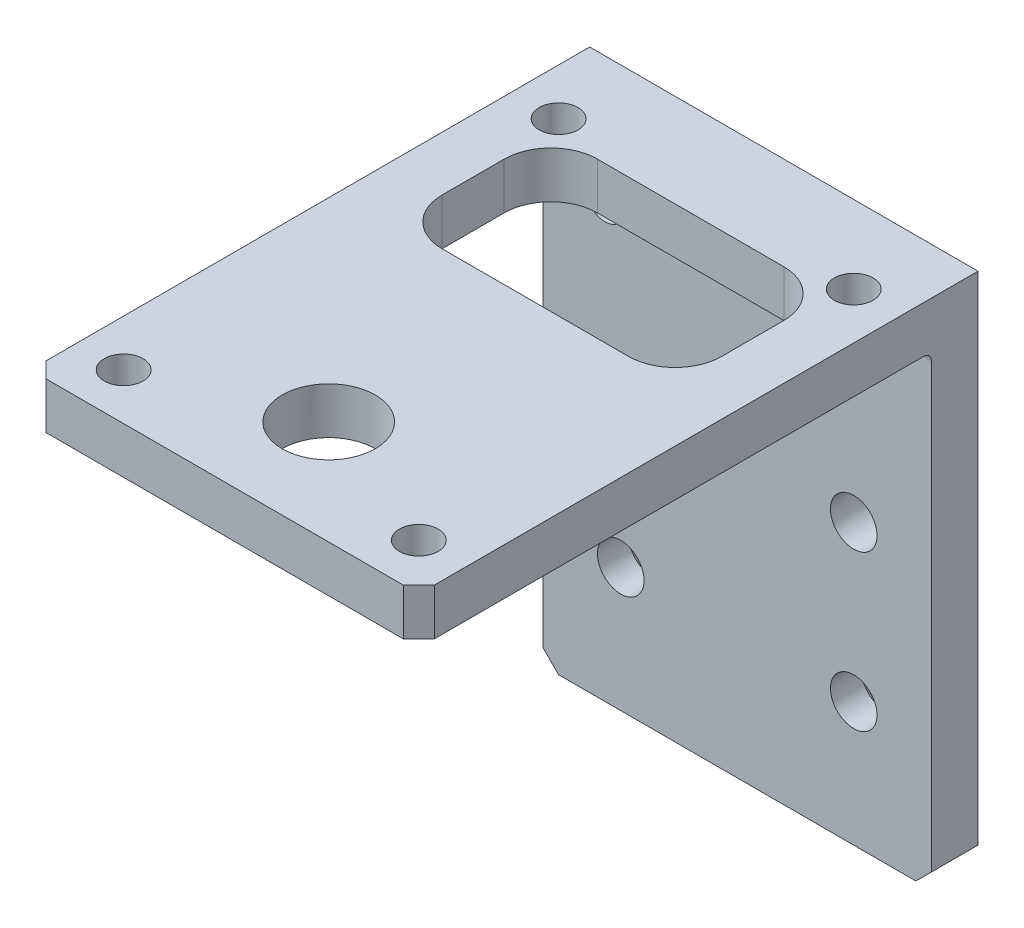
ISO-10303-21;
HEADER;
FILE_DESCRIPTION(('STEP AP214'),'2;1');
FILE_NAME('part.step','',(''),(''),'','','');
FILE_SCHEMA(('AUTOMOTIVE_DESIGN { 1 0 10303 214 1 1 1 1 }'));
ENDSEC;
DATA;
#1=APPLICATION_CONTEXT('core data for automotive mechanical design processes');
#2=APPLICATION_PROTOCOL_DEFINITION('international standard','automotive_design',2000,#1);
#3=PRODUCT_CONTEXT('',#1,'mechanical');
#4=PRODUCT('Part','Part','',(#3));
#5=PRODUCT_RELATED_PRODUCT_CATEGORY('part','',(#4));
#6=PRODUCT_DEFINITION_FORMATION('','',#4);
#7=PRODUCT_DEFINITION_CONTEXT('part definition',#1,'design');
#8=PRODUCT_DEFINITION('design','',#6,#7);
#9=PRODUCT_DEFINITION_SHAPE('','',#8);
#10=(LENGTH_UNIT() NAMED_UNIT(*) SI_UNIT(.MILLI.,.METRE.));
#11=(NAMED_UNIT(*) PLANE_ANGLE_UNIT() SI_UNIT($,.RADIAN.));
#12=(NAMED_UNIT(*) SI_UNIT($,.STERADIAN.) SOLID_ANGLE_UNIT());
#13=UNCERTAINTY_MEASURE_WITH_UNIT(LENGTH_MEASURE(1.E-05),#10,'distance_accuracy_value','');
#14=(GEOMETRIC_REPRESENTATION_CONTEXT(3) GLOBAL_UNCERTAINTY_ASSIGNED_CONTEXT((#13)) GLOBAL_UNIT_ASSIGNED_CONTEXT((#10,
#11,#12)) REPRESENTATION_CONTEXT('',''));
#15=CARTESIAN_POINT('',(0.,0.,0.));
#16=DIRECTION('',(0.,0.,1.));
#17=DIRECTION('',(1.,0.,0.));
#18=AXIS2_PLACEMENT_3D('',#15,#16,#17);
#19=CARTESIAN_POINT('',(-12.6575497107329,0.,-9.5));
#20=DIRECTION('',(0.,1.,0.));
#21=DIRECTION('',(-1.,0.,0.));
#22=AXIS2_PLACEMENT_3D('',#19,#20,#21);
#23=PLANE('',#22);
#24=CARTESIAN_POINT('',(9.34245028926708,0.,-7.5));
#25=DIRECTION('',(0.,1.,0.));
#26=DIRECTION('',(-1.,0.,0.));
#27=AXIS2_PLACEMENT_3D('',#24,#25,#26);
#28=CIRCLE('',#27,1.25);
#29=CARTESIAN_POINT('',(8.09245028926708,0.,-7.5));
#30=VERTEX_POINT('',#29);
#31=EDGE_CURVE('E769',#30,#30,#28,.F.);
#32=ORIENTED_EDGE('',*,*,#31,.F.);
#33=EDGE_LOOP('',(#32));
#34=FACE_BOUND('',#33,.T.);
#35=CARTESIAN_POINT('',(9.34245028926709,0.,20.5));
#36=DIRECTION('',(0.,1.,0.));
#37=DIRECTION('',(-1.,0.,0.));
#38=AXIS2_PLACEMENT_3D('',#35,#36,#37);
#39=CIRCLE('',#38,1.25);
#40=CARTESIAN_POINT('',(8.09245028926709,0.,20.5));
#41=VERTEX_POINT('',#40);
#42=EDGE_CURVE('E763',#41,#41,#39,.F.);
#43=ORIENTED_EDGE('',*,*,#42,.F.);
#44=EDGE_LOOP('',(#43));
#45=FACE_BOUND('',#44,.T.);
#46=CARTESIAN_POINT('',(-9.65754971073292,0.,20.5));
#47=DIRECTION('',(0.,1.,0.));
#48=DIRECTION('',(-1.,0.,0.));
#49=AXIS2_PLACEMENT_3D('',#46,#47,#48);
#50=CIRCLE('',#49,1.25);
#51=CARTESIAN_POINT('',(-10.9075497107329,0.,20.5));
#52=VERTEX_POINT('',#51);
#53=EDGE_CURVE('E750',#52,#52,#50,.F.);
#54=ORIENTED_EDGE('',*,*,#53,.F.);
#55=EDGE_LOOP('',(#54));
#56=FACE_BOUND('',#55,.T.);
#57=DIRECTION('',(0.,0.,1.));
#58=VECTOR('',#57,1.);
#59=CARTESIAN_POINT('',(-12.6575497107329,0.,-9.5));
#60=LINE('',#59,#58);
#61=CARTESIAN_POINT('',(-12.6575497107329,0.,-9.));
#62=VERTEX_POINT('',#61);
#63=CARTESIAN_POINT('',(-12.6575497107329,0.,22.5));
#64=VERTEX_POINT('',#63);
#65=EDGE_CURVE('E209',#62,#64,#60,.T.);
#66=ORIENTED_EDGE('',*,*,#65,.F.);
#67=DIRECTION('',(1.,0.,0.));
#68=VECTOR('',#67,1.);
#69=CARTESIAN_POINT('',(12.3424502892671,0.,-9.));
#70=LINE('',#69,#68);
#71=CARTESIAN_POINT('',(12.3424502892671,0.,-9.));
#72=VERTEX_POINT('',#71);
#73=EDGE_CURVE('E305',#62,#72,#70,.T.);
#74=ORIENTED_EDGE('',*,*,#73,.T.);
#75=DIRECTION('',(0.,0.,1.));
#76=VECTOR('',#75,1.);
#77=CARTESIAN_POINT('',(12.3424502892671,0.,-9.5));
#78=LINE('',#77,#76);
#79=CARTESIAN_POINT('',(12.3424502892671,0.,22.5));
#80=VERTEX_POINT('',#79);
#81=EDGE_CURVE('E210',#72,#80,#78,.T.);
#82=ORIENTED_EDGE('',*,*,#81,.T.);
#83=DIRECTION('',(-0.707106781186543,0.,0.707106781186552));
#84=VECTOR('',#83,1.);
#85=CARTESIAN_POINT('',(11.3424502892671,0.,23.5));
#86=LINE('',#85,#84);
#87=CARTESIAN_POINT('',(11.3424502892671,0.,23.5));
#88=VERTEX_POINT('',#87);
#89=EDGE_CURVE('E300',#80,#88,#86,.T.);
#90=ORIENTED_EDGE('',*,*,#89,.T.);
#91=DIRECTION('',(1.,0.,0.));
#92=VECTOR('',#91,1.);
#93=CARTESIAN_POINT('',(-12.6575497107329,0.,23.5));
#94=LINE('',#93,#92);
#95=CARTESIAN_POINT('',(-11.6575497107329,0.,23.5));
#96=VERTEX_POINT('',#95);
#97=EDGE_CURVE('E216',#96,#88,#94,.T.);
#98=ORIENTED_EDGE('',*,*,#97,.F.);
#99=DIRECTION('',(0.707106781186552,0.,0.707106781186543));
#100=VECTOR('',#99,1.);
#101=CARTESIAN_POINT('',(-12.6575497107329,0.,22.5));
#102=LINE('',#101,#100);
#103=EDGE_CURVE('E302',#96,#64,#102,.F.);
#104=ORIENTED_EDGE('',*,*,#103,.T.);
#105=EDGE_LOOP('',(#66,#74,#82,#90,#98,#104));
#106=FACE_BOUND('',#105,.T.);
#107=DIRECTION('',(-1.,0.,0.));
#108=VECTOR('',#107,1.);
#109=CARTESIAN_POINT('',(-12.6575497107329,0.,-6.5));
#110=LINE('',#109,#108);
#111=CARTESIAN_POINT('',(5.84245028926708,0.,-6.5));
#112=VERTEX_POINT('',#111);
#113=CARTESIAN_POINT('',(-6.15754971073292,0.,-6.5));
#114=VERTEX_POINT('',#113);
#115=EDGE_CURVE('E248',#112,#114,#110,.T.);
#116=ORIENTED_EDGE('',*,*,#115,.T.);
#117=CARTESIAN_POINT('',(-6.15754971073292,0.,-3.5));
#118=DIRECTION('',(0.,1.,0.));
#119=DIRECTION('',(-1.,0.,0.));
#120=AXIS2_PLACEMENT_3D('',#117,#118,#119);
#121=CIRCLE('',#120,3.);
#122=CARTESIAN_POINT('',(-9.15754971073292,0.,-3.5));
#123=VERTEX_POINT('',#122);
#124=EDGE_CURVE('E251',#114,#123,#121,.T.);
#125=ORIENTED_EDGE('',*,*,#124,.T.);
#126=DIRECTION('',(0.,0.,1.));
#127=VECTOR('',#126,1.);
#128=CARTESIAN_POINT('',(-9.15754971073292,0.,-9.5));
#129=LINE('',#128,#127);
#130=CARTESIAN_POINT('',(-9.15754971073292,0.,0.5));
#131=VERTEX_POINT('',#130);
#132=EDGE_CURVE('E235',#123,#131,#129,.T.);
#133=ORIENTED_EDGE('',*,*,#132,.T.);
#134=CARTESIAN_POINT('',(-6.15754971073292,0.,0.500000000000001));
#135=DIRECTION('',(0.,1.,0.));
#136=DIRECTION('',(-1.,0.,0.));
#137=AXIS2_PLACEMENT_3D('',#134,#135,#136);
#138=CIRCLE('',#137,3.);
#139=CARTESIAN_POINT('',(-6.15754971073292,0.,3.5));
#140=VERTEX_POINT('',#139);
#141=EDGE_CURVE('E326',#131,#140,#138,.T.);
#142=ORIENTED_EDGE('',*,*,#141,.T.);
#143=DIRECTION('',(1.,0.,0.));
#144=VECTOR('',#143,1.);
#145=CARTESIAN_POINT('',(-12.6575497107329,0.,3.5));
#146=LINE('',#145,#144);
#147=CARTESIAN_POINT('',(5.84245028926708,0.,3.5));
#148=VERTEX_POINT('',#147);
#149=EDGE_CURVE('E242',#140,#148,#146,.T.);
#150=ORIENTED_EDGE('',*,*,#149,.T.);
#151=CARTESIAN_POINT('',(5.84245028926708,0.,0.500000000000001));
#152=DIRECTION('',(0.,1.,0.));
#153=DIRECTION('',(-1.,0.,0.));
#154=AXIS2_PLACEMENT_3D('',#151,#152,#153);
#155=CIRCLE('',#154,3.);
#156=CARTESIAN_POINT('',(8.84245028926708,0.,0.500000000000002));
#157=VERTEX_POINT('',#156);
#158=EDGE_CURVE('E323',#148,#157,#155,.T.);
#159=ORIENTED_EDGE('',*,*,#158,.T.);
#160=DIRECTION('',(0.,0.,-1.));
#161=VECTOR('',#160,1.);
#162=CARTESIAN_POINT('',(8.84245028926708,0.,-9.5));
#163=LINE('',#162,#161);
#164=CARTESIAN_POINT('',(8.84245028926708,0.,-3.5));
#165=VERTEX_POINT('',#164);
#166=EDGE_CURVE('E245',#157,#165,#163,.T.);
#167=ORIENTED_EDGE('',*,*,#166,.T.);
#168=CARTESIAN_POINT('',(5.84245028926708,0.,-3.5));
#169=DIRECTION('',(0.,1.,0.));
#170=DIRECTION('',(-1.,0.,0.));
#171=AXIS2_PLACEMENT_3D('',#168,#169,#170);
#172=CIRCLE('',#171,3.);
#173=EDGE_CURVE('E187',#165,#112,#172,.T.);
#174=ORIENTED_EDGE('',*,*,#173,.T.);
#175=EDGE_LOOP('',(#116,#125,#133,#142,#150,#159,#167,#174));
#176=FACE_BOUND('',#175,.T.);
#177=CARTESIAN_POINT('',(-0.157549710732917,0.,16.8));
#178=DIRECTION('',(0.,1.,0.));
#179=DIRECTION('',(-1.,0.,0.));
#180=AXIS2_PLACEMENT_3D('',#177,#178,#179);
#181=CIRCLE('',#180,2.99999999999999);
#182=CARTESIAN_POINT('',(-3.15754971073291,0.,16.8));
#183=VERTEX_POINT('',#182);
#184=EDGE_CURVE('E264',#183,#183,#181,.T.);
#185=ORIENTED_EDGE('',*,*,#184,.T.);
#186=EDGE_LOOP('',(#185));
#187=FACE_BOUND('',#186,.T.);
#188=CARTESIAN_POINT('',(-9.65754971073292,0.,-7.5));
#189=DIRECTION('',(0.,1.,0.));
#190=DIRECTION('',(-1.,0.,0.));
#191=AXIS2_PLACEMENT_3D('',#188,#189,#190);
#192=CIRCLE('',#191,1.25);
#193=CARTESIAN_POINT('',(-10.9075497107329,0.,-7.5));
#194=VERTEX_POINT('',#193);
#195=EDGE_CURVE('E745',#194,#194,#192,.F.);
#196=ORIENTED_EDGE('',*,*,#195,.F.);
#197=EDGE_LOOP('',(#196));
#198=FACE_BOUND('',#197,.T.);
#199=ADVANCED_FACE('F36',(#34,#45,#56,#106,#176,#187,#198),#23,.F.);
#200=CARTESIAN_POINT('',(12.3424502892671,3.,23.5));
#201=DIRECTION('',(0.,1.,0.));
#202=DIRECTION('',(0.,0.,1.));
#203=AXIS2_PLACEMENT_3D('',#200,#201,#202);
#204=PLANE('',#203);
#205=CARTESIAN_POINT('',(9.34245028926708,3.,-7.5));
#206=DIRECTION('',(0.,1.,0.));
#207=DIRECTION('',(0.,0.,1.));
#208=AXIS2_PLACEMENT_3D('',#205,#206,#207);
#209=CIRCLE('',#208,1.25);
#210=CARTESIAN_POINT('',(9.34245028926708,3.,-6.25));
#211=VERTEX_POINT('',#210);
#212=EDGE_CURVE('E772',#211,#211,#209,.T.);
#213=ORIENTED_EDGE('',*,*,#212,.F.);
#214=EDGE_LOOP('',(#213));
#215=FACE_BOUND('',#214,.T.);
#216=CARTESIAN_POINT('',(9.34245028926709,3.,20.5));
#217=DIRECTION('',(0.,1.,0.));
#218=DIRECTION('',(0.,0.,1.));
#219=AXIS2_PLACEMENT_3D('',#216,#217,#218);
#220=CIRCLE('',#219,1.25);
#221=CARTESIAN_POINT('',(9.34245028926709,3.,21.75));
#222=VERTEX_POINT('',#221);
#223=EDGE_CURVE('E766',#222,#222,#220,.T.);
#224=ORIENTED_EDGE('',*,*,#223,.F.);
#225=EDGE_LOOP('',(#224));
#226=FACE_BOUND('',#225,.T.);
#227=CARTESIAN_POINT('',(-9.65754971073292,3.,20.5));
#228=DIRECTION('',(0.,1.,0.));
#229=DIRECTION('',(0.,0.,1.));
#230=AXIS2_PLACEMENT_3D('',#227,#228,#229);
#231=CIRCLE('',#230,1.25);
#232=CARTESIAN_POINT('',(-9.65754971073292,3.,21.75));
#233=VERTEX_POINT('',#232);
#234=EDGE_CURVE('E753',#233,#233,#231,.T.);
#235=ORIENTED_EDGE('',*,*,#234,.F.);
#236=EDGE_LOOP('',(#235));
#237=FACE_BOUND('',#236,.T.);
#238=CARTESIAN_POINT('',(-9.65754971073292,3.,-7.5));
#239=DIRECTION('',(0.,1.,0.));
#240=DIRECTION('',(0.,0.,1.));
#241=AXIS2_PLACEMENT_3D('',#238,#239,#240);
#242=CIRCLE('',#241,1.25);
#243=CARTESIAN_POINT('',(-9.65754971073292,3.,-6.25));
#244=VERTEX_POINT('',#243);
#245=EDGE_CURVE('E746',#244,#244,#242,.T.);
#246=ORIENTED_EDGE('',*,*,#245,.F.);
#247=EDGE_LOOP('',(#246));
#248=FACE_BOUND('',#247,.T.);
#249=CARTESIAN_POINT('',(-0.157549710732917,3.,16.8));
#250=DIRECTION('',(0.,1.,0.));
#251=DIRECTION('',(0.,0.,1.));
#252=AXIS2_PLACEMENT_3D('',#249,#250,#251);
#253=CIRCLE('',#252,2.99999999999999);
#254=CARTESIAN_POINT('',(-0.157549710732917,3.,19.8));
#255=VERTEX_POINT('',#254);
#256=EDGE_CURVE('E267',#255,#255,#253,.T.);
#257=ORIENTED_EDGE('',*,*,#256,.F.);
#258=EDGE_LOOP('',(#257));
#259=FACE_BOUND('',#258,.T.);
#260=CARTESIAN_POINT('',(-6.15754971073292,3.,-3.5));
#261=DIRECTION('',(0.,1.,0.));
#262=DIRECTION('',(0.,0.,1.));
#263=AXIS2_PLACEMENT_3D('',#260,#261,#262);
#264=CIRCLE('',#263,3.);
#265=CARTESIAN_POINT('',(-6.15754971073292,3.,-6.5));
#266=VERTEX_POINT('',#265);
#267=CARTESIAN_POINT('',(-9.15754971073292,3.,-3.5));
#268=VERTEX_POINT('',#267);
#269=EDGE_CURVE('E354',#266,#268,#264,.T.);
#270=ORIENTED_EDGE('',*,*,#269,.F.);
#271=DIRECTION('',(-1.,0.,0.));
#272=VECTOR('',#271,1.);
#273=CARTESIAN_POINT('',(5.84245028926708,3.,-6.5));
#274=LINE('',#273,#272);
#275=CARTESIAN_POINT('',(5.84245028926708,3.,-6.5));
#276=VERTEX_POINT('',#275);
#277=EDGE_CURVE('E195',#276,#266,#274,.T.);
#278=ORIENTED_EDGE('',*,*,#277,.F.);
#279=CARTESIAN_POINT('',(5.84245028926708,3.,-3.5));
#280=DIRECTION('',(0.,1.,0.));
#281=DIRECTION('',(0.,0.,1.));
#282=AXIS2_PLACEMENT_3D('',#279,#280,#281);
#283=CIRCLE('',#282,3.);
#284=CARTESIAN_POINT('',(8.84245028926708,3.,-3.5));
#285=VERTEX_POINT('',#284);
#286=EDGE_CURVE('E177',#285,#276,#283,.T.);
#287=ORIENTED_EDGE('',*,*,#286,.F.);
#288=DIRECTION('',(0.,0.,-1.));
#289=VECTOR('',#288,1.);
#290=CARTESIAN_POINT('',(8.84245028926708,3.,3.5));
#291=LINE('',#290,#289);
#292=CARTESIAN_POINT('',(8.84245028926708,3.,0.500000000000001));
#293=VERTEX_POINT('',#292);
#294=EDGE_CURVE('E169',#293,#285,#291,.T.);
#295=ORIENTED_EDGE('',*,*,#294,.F.);
#296=CARTESIAN_POINT('',(5.84245028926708,3.,0.500000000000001));
#297=DIRECTION('',(0.,1.,0.));
#298=DIRECTION('',(0.,0.,1.));
#299=AXIS2_PLACEMENT_3D('',#296,#297,#298);
#300=CIRCLE('',#299,3.);
#301=CARTESIAN_POINT('',(5.84245028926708,3.,3.5));
#302=VERTEX_POINT('',#301);
#303=EDGE_CURVE('E321',#293,#302,#300,.F.);
#304=ORIENTED_EDGE('',*,*,#303,.T.);
#305=DIRECTION('',(1.,0.,0.));
#306=VECTOR('',#305,1.);
#307=CARTESIAN_POINT('',(-9.15754971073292,3.,3.5));
#308=LINE('',#307,#306);
#309=CARTESIAN_POINT('',(-6.15754971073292,3.,3.5));
#310=VERTEX_POINT('',#309);
#311=EDGE_CURVE('E178',#310,#302,#308,.T.);
#312=ORIENTED_EDGE('',*,*,#311,.F.);
#313=CARTESIAN_POINT('',(-6.15754971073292,3.,0.500000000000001));
#314=DIRECTION('',(0.,1.,0.));
#315=DIRECTION('',(0.,0.,1.));
#316=AXIS2_PLACEMENT_3D('',#313,#314,#315);
#317=CIRCLE('',#316,3.);
#318=CARTESIAN_POINT('',(-9.15754971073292,3.,0.500000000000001));
#319=VERTEX_POINT('',#318);
#320=EDGE_CURVE('E59',#310,#319,#317,.F.);
#321=ORIENTED_EDGE('',*,*,#320,.T.);
#322=DIRECTION('',(0.,0.,1.));
#323=VECTOR('',#322,1.);
#324=CARTESIAN_POINT('',(-9.15754971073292,3.,-3.5));
#325=LINE('',#324,#323);
#326=EDGE_CURVE('E356',#268,#319,#325,.T.);
#327=ORIENTED_EDGE('',*,*,#326,.F.);
#328=EDGE_LOOP('',(#270,#278,#287,#295,#304,#312,#321,#327));
#329=FACE_BOUND('',#328,.T.);
#330=DIRECTION('',(0.,0.,-1.));
#331=VECTOR('',#330,1.);
#332=CARTESIAN_POINT('',(-12.6575497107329,3.,23.5));
#333=LINE('',#332,#331);
#334=CARTESIAN_POINT('',(-12.6575497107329,3.,22.5));
#335=VERTEX_POINT('',#334);
#336=CARTESIAN_POINT('',(-12.6575497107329,3.,-12.5));
#337=VERTEX_POINT('',#336);
#338=EDGE_CURVE('E219',#335,#337,#333,.T.);
#339=ORIENTED_EDGE('',*,*,#338,.F.);
#340=DIRECTION('',(-0.707106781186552,0.,-0.707106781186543));
#341=VECTOR('',#340,1.);
#342=CARTESIAN_POINT('',(0.342450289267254,3.,35.5));
#343=LINE('',#342,#341);
#344=CARTESIAN_POINT('',(-11.6575497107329,3.,23.5));
#345=VERTEX_POINT('',#344);
#346=EDGE_CURVE('E293',#335,#345,#343,.F.);
#347=ORIENTED_EDGE('',*,*,#346,.T.);
#348=DIRECTION('',(-1.,0.,0.));
#349=VECTOR('',#348,1.);
#350=CARTESIAN_POINT('',(12.3424502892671,3.,23.5));
#351=LINE('',#350,#349);
#352=CARTESIAN_POINT('',(11.3424502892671,3.,23.5));
#353=VERTEX_POINT('',#352);
#354=EDGE_CURVE('E232',#353,#345,#351,.T.);
#355=ORIENTED_EDGE('',*,*,#354,.F.);
#356=DIRECTION('',(0.707106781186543,0.,-0.707106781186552));
#357=VECTOR('',#356,1.);
#358=CARTESIAN_POINT('',(11.8424502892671,3.,23.));
#359=LINE('',#358,#357);
#360=CARTESIAN_POINT('',(12.3424502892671,3.,22.5));
#361=VERTEX_POINT('',#360);
#362=EDGE_CURVE('E291',#353,#361,#359,.T.);
#363=ORIENTED_EDGE('',*,*,#362,.T.);
#364=DIRECTION('',(0.,0.,-1.));
#365=VECTOR('',#364,1.);
#366=CARTESIAN_POINT('',(12.3424502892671,3.,23.5));
#367=LINE('',#366,#365);
#368=CARTESIAN_POINT('',(12.3424502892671,3.,-12.5));
#369=VERTEX_POINT('',#368);
#370=EDGE_CURVE('E222',#361,#369,#367,.T.);
#371=ORIENTED_EDGE('',*,*,#370,.T.);
#372=DIRECTION('',(-1.,0.,0.));
#373=VECTOR('',#372,1.);
#374=CARTESIAN_POINT('',(12.3424502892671,3.,-12.5));
#375=LINE('',#374,#373);
#376=EDGE_CURVE('E228',#369,#337,#375,.T.);
#377=ORIENTED_EDGE('',*,*,#376,.T.);
#378=EDGE_LOOP('',(#339,#347,#355,#363,#371,#377));
#379=FACE_BOUND('',#378,.T.);
#380=ADVANCED_FACE('F192',(#215,#226,#237,#248,#259,#329,#379),#204,.T.);
#381=CARTESIAN_POINT('',(12.3424502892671,-30.,23.5));
#382=DIRECTION('',(0.,0.,1.));
#383=DIRECTION('',(1.,0.,0.));
#384=AXIS2_PLACEMENT_3D('',#381,#382,#383);
#385=PLANE('',#384);
#386=ORIENTED_EDGE('',*,*,#354,.T.);
#387=DIRECTION('',(0.,-1.,0.));
#388=VECTOR('',#387,1.);
#389=CARTESIAN_POINT('',(-11.6575497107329,-30.,23.5));
#390=LINE('',#389,#388);
#391=EDGE_CURVE('E298',#345,#96,#390,.T.);
#392=ORIENTED_EDGE('',*,*,#391,.T.);
#393=ORIENTED_EDGE('',*,*,#97,.T.);
#394=DIRECTION('',(0.,1.,0.));
#395=VECTOR('',#394,1.);
#396=CARTESIAN_POINT('',(11.3424502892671,3.,23.5));
#397=LINE('',#396,#395);
#398=EDGE_CURVE('E295',#88,#353,#397,.T.);
#399=ORIENTED_EDGE('',*,*,#398,.T.);
#400=EDGE_LOOP('',(#386,#392,#393,#399));
#401=FACE_BOUND('',#400,.T.);
#402=ADVANCED_FACE('F392',(#401),#385,.T.);
#403=CARTESIAN_POINT('',(12.3424502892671,-30.,-12.5));
#404=DIRECTION('',(0.,-1.,0.));
#405=DIRECTION('',(0.,0.,-1.));
#406=AXIS2_PLACEMENT_3D('',#403,#404,#405);
#407=PLANE('',#406);
#408=DIRECTION('',(1.,0.,0.));
#409=VECTOR('',#408,1.);
#410=CARTESIAN_POINT('',(-12.6575497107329,-30.,-9.5));
#411=LINE('',#410,#409);
#412=CARTESIAN_POINT('',(-11.6575497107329,-30.,-9.5));
#413=VERTEX_POINT('',#412);
#414=CARTESIAN_POINT('',(11.3424502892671,-30.,-9.5));
#415=VERTEX_POINT('',#414);
#416=EDGE_CURVE('E212',#413,#415,#411,.T.);
#417=ORIENTED_EDGE('',*,*,#416,.F.);
#418=DIRECTION('',(0.,0.,-1.));
#419=VECTOR('',#418,1.);
#420=CARTESIAN_POINT('',(-11.6575497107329,-30.,-12.5));
#421=LINE('',#420,#419);
#422=CARTESIAN_POINT('',(-11.6575497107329,-30.,-12.5));
#423=VERTEX_POINT('',#422);
#424=EDGE_CURVE('E280',#413,#423,#421,.T.);
#425=ORIENTED_EDGE('',*,*,#424,.T.);
#426=DIRECTION('',(-1.,0.,0.));
#427=VECTOR('',#426,1.);
#428=CARTESIAN_POINT('',(12.3424502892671,-30.,-12.5));
#429=LINE('',#428,#427);
#430=CARTESIAN_POINT('',(11.3424502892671,-30.,-12.5));
#431=VERTEX_POINT('',#430);
#432=EDGE_CURVE('E236',#431,#423,#429,.T.);
#433=ORIENTED_EDGE('',*,*,#432,.F.);
#434=DIRECTION('',(0.,0.,1.));
#435=VECTOR('',#434,1.);
#436=CARTESIAN_POINT('',(11.3424502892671,-30.,-9.5));
#437=LINE('',#436,#435);
#438=EDGE_CURVE('E277',#431,#415,#437,.T.);
#439=ORIENTED_EDGE('',*,*,#438,.T.);
#440=EDGE_LOOP('',(#417,#425,#433,#439));
#441=FACE_BOUND('',#440,.T.);
#442=ADVANCED_FACE('F415',(#441),#407,.T.);
#443=CARTESIAN_POINT('',(12.3424502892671,3.,-12.5));
#444=DIRECTION('',(0.,0.,-1.));
#445=DIRECTION('',(-1.,0.,0.));
#446=AXIS2_PLACEMENT_3D('',#443,#444,#445);
#447=PLANE('',#446);
#448=CARTESIAN_POINT('',(7.3424502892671,-22.,-12.5));
#449=DIRECTION('',(0.,0.,-1.));
#450=DIRECTION('',(-1.,0.,0.));
#451=AXIS2_PLACEMENT_3D('',#448,#449,#450);
#452=CIRCLE('',#451,2.5);
#453=CARTESIAN_POINT('',(4.8424502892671,-22.,-12.5));
#454=VERTEX_POINT('',#453);
#455=EDGE_CURVE('E44',#454,#454,#452,.F.);
#456=ORIENTED_EDGE('',*,*,#455,.T.);
#457=EDGE_LOOP('',(#456));
#458=FACE_BOUND('',#457,.T.);
#459=CARTESIAN_POINT('',(-7.6575497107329,-22.,-12.5));
#460=DIRECTION('',(0.,0.,-1.));
#461=DIRECTION('',(-1.,0.,0.));
#462=AXIS2_PLACEMENT_3D('',#459,#460,#461);
#463=CIRCLE('',#462,2.5);
#464=CARTESIAN_POINT('',(-10.1575497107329,-22.,-12.5));
#465=VERTEX_POINT('',#464);
#466=EDGE_CURVE('E331',#465,#465,#463,.F.);
#467=ORIENTED_EDGE('',*,*,#466,.T.);
#468=EDGE_LOOP('',(#467));
#469=FACE_BOUND('',#468,.T.);
#470=CARTESIAN_POINT('',(8.34245028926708,-2.,-12.5));
#471=DIRECTION('',(0.,0.,-1.));
#472=DIRECTION('',(-1.,0.,0.));
#473=AXIS2_PLACEMENT_3D('',#470,#471,#472);
#474=CIRCLE('',#473,1.24999999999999);
#475=CARTESIAN_POINT('',(7.0924502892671,-2.,-12.5));
#476=VERTEX_POINT('',#475);
#477=EDGE_CURVE('E786',#476,#476,#474,.T.);
#478=ORIENTED_EDGE('',*,*,#477,.F.);
#479=EDGE_LOOP('',(#478));
#480=FACE_BOUND('',#479,.T.);
#481=CARTESIAN_POINT('',(-8.65754971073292,-2.,-12.5));
#482=DIRECTION('',(0.,0.,-1.));
#483=DIRECTION('',(-1.,0.,0.));
#484=AXIS2_PLACEMENT_3D('',#481,#482,#483);
#485=CIRCLE('',#484,1.24999999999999);
#486=CARTESIAN_POINT('',(-9.90754971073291,-2.,-12.5));
#487=VERTEX_POINT('',#486);
#488=EDGE_CURVE('E780',#487,#487,#485,.T.);
#489=ORIENTED_EDGE('',*,*,#488,.F.);
#490=EDGE_LOOP('',(#489));
#491=FACE_BOUND('',#490,.T.);
#492=CARTESIAN_POINT('',(7.3424502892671,-12.,-12.5));
#493=DIRECTION('',(0.,0.,-1.));
#494=DIRECTION('',(-1.,0.,0.));
#495=AXIS2_PLACEMENT_3D('',#492,#493,#494);
#496=CIRCLE('',#495,1.5);
#497=CARTESIAN_POINT('',(5.84245028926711,-12.,-12.5));
#498=VERTEX_POINT('',#497);
#499=EDGE_CURVE('E263',#498,#498,#496,.T.);
#500=ORIENTED_EDGE('',*,*,#499,.F.);
#501=EDGE_LOOP('',(#500));
#502=FACE_BOUND('',#501,.T.);
#503=CARTESIAN_POINT('',(-7.6575497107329,-12.,-12.5));
#504=DIRECTION('',(0.,0.,-1.));
#505=DIRECTION('',(-1.,0.,0.));
#506=AXIS2_PLACEMENT_3D('',#503,#504,#505);
#507=CIRCLE('',#506,1.5);
#508=CARTESIAN_POINT('',(-9.15754971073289,-12.,-12.5));
#509=VERTEX_POINT('',#508);
#510=EDGE_CURVE('E259',#509,#509,#507,.T.);
#511=ORIENTED_EDGE('',*,*,#510,.F.);
#512=EDGE_LOOP('',(#511));
#513=FACE_BOUND('',#512,.T.);
#514=ORIENTED_EDGE('',*,*,#432,.T.);
#515=DIRECTION('',(0.707106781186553,-0.707106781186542,0.));
#516=VECTOR('',#515,1.);
#517=CARTESIAN_POINT('',(-16.1575497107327,-25.5000000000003,-12.5));
#518=LINE('',#517,#516);
#519=CARTESIAN_POINT('',(-12.6575497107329,-29.,-12.5));
#520=VERTEX_POINT('',#519);
#521=EDGE_CURVE('E284',#423,#520,#518,.F.);
#522=ORIENTED_EDGE('',*,*,#521,.T.);
#523=DIRECTION('',(0.,-1.,0.));
#524=VECTOR('',#523,1.);
#525=CARTESIAN_POINT('',(-12.6575497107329,3.,-12.5));
#526=LINE('',#525,#524);
#527=EDGE_CURVE('E225',#337,#520,#526,.T.);
#528=ORIENTED_EDGE('',*,*,#527,.F.);
#529=ORIENTED_EDGE('',*,*,#376,.F.);
#530=DIRECTION('',(0.,-1.,0.));
#531=VECTOR('',#530,1.);
#532=CARTESIAN_POINT('',(12.3424502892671,3.,-12.5));
#533=LINE('',#532,#531);
#534=CARTESIAN_POINT('',(12.3424502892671,-29.,-12.5));
#535=VERTEX_POINT('',#534);
#536=EDGE_CURVE('E224',#369,#535,#533,.T.);
#537=ORIENTED_EDGE('',*,*,#536,.T.);
#538=DIRECTION('',(-0.707106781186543,-0.707106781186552,0.));
#539=VECTOR('',#538,1.);
#540=CARTESIAN_POINT('',(28.3424502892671,-12.9999999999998,-12.5));
#541=LINE('',#540,#539);
#542=EDGE_CURVE('E282',#535,#431,#541,.T.);
#543=ORIENTED_EDGE('',*,*,#542,.T.);
#544=EDGE_LOOP('',(#514,#522,#528,#529,#537,#543));
#545=FACE_BOUND('',#544,.T.);
#546=ADVANCED_FACE('F336',(#458,#469,#480,#491,#502,#513,#545),#447,.T.);
#547=CARTESIAN_POINT('',(12.3424502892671,0.,0.));
#548=DIRECTION('',(-1.,0.,0.));
#549=DIRECTION('',(0.,0.,1.));
#550=AXIS2_PLACEMENT_3D('',#547,#548,#549);
#551=PLANE('',#550);
#552=DIRECTION('',(0.,1.,0.));
#553=VECTOR('',#552,1.);
#554=CARTESIAN_POINT('',(12.3424502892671,-30.,-9.5));
#555=LINE('',#554,#553);
#556=CARTESIAN_POINT('',(12.3424502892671,-29.,-9.5));
#557=VERTEX_POINT('',#556);
#558=CARTESIAN_POINT('',(12.3424502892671,-0.500000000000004,-9.5));
#559=VERTEX_POINT('',#558);
#560=EDGE_CURVE('E202',#557,#559,#555,.T.);
#561=ORIENTED_EDGE('',*,*,#560,.F.);
#562=DIRECTION('',(0.,0.,-1.));
#563=VECTOR('',#562,1.);
#564=CARTESIAN_POINT('',(12.3424502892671,-29.,-12.5));
#565=LINE('',#564,#563);
#566=EDGE_CURVE('E289',#557,#535,#565,.T.);
#567=ORIENTED_EDGE('',*,*,#566,.T.);
#568=ORIENTED_EDGE('',*,*,#536,.F.);
#569=ORIENTED_EDGE('',*,*,#370,.F.);
#570=DIRECTION('',(0.,-1.,0.));
#571=VECTOR('',#570,1.);
#572=CARTESIAN_POINT('',(12.3424502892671,0.,22.5));
#573=LINE('',#572,#571);
#574=EDGE_CURVE('E286',#361,#80,#573,.T.);
#575=ORIENTED_EDGE('',*,*,#574,.T.);
#576=ORIENTED_EDGE('',*,*,#81,.F.);
#577=CARTESIAN_POINT('',(12.3424502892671,-0.499999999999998,-9.));
#578=DIRECTION('',(-1.,0.,0.));
#579=DIRECTION('',(0.,0.,1.));
#580=AXIS2_PLACEMENT_3D('',#577,#578,#579);
#581=CIRCLE('',#580,0.5);
#582=EDGE_CURVE('E310',#72,#559,#581,.T.);
#583=ORIENTED_EDGE('',*,*,#582,.T.);
#584=EDGE_LOOP('',(#561,#567,#568,#569,#575,#576,#583));
#585=FACE_BOUND('',#584,.T.);
#586=ADVANCED_FACE('F406',(#585),#551,.F.);
#587=CARTESIAN_POINT('',(-12.6575497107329,0.,0.));
#588=DIRECTION('',(-1.,0.,0.));
#589=DIRECTION('',(0.,0.,1.));
#590=AXIS2_PLACEMENT_3D('',#587,#588,#589);
#591=PLANE('',#590);
#592=ORIENTED_EDGE('',*,*,#527,.T.);
#593=DIRECTION('',(0.,0.,1.));
#594=VECTOR('',#593,1.);
#595=CARTESIAN_POINT('',(-12.6575497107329,-29.,0.));
#596=LINE('',#595,#594);
#597=CARTESIAN_POINT('',(-12.6575497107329,-29.,-9.5));
#598=VERTEX_POINT('',#597);
#599=EDGE_CURVE('E270',#520,#598,#596,.T.);
#600=ORIENTED_EDGE('',*,*,#599,.T.);
#601=DIRECTION('',(0.,1.,0.));
#602=VECTOR('',#601,1.);
#603=CARTESIAN_POINT('',(-12.6575497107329,-30.,-9.5));
#604=LINE('',#603,#602);
#605=CARTESIAN_POINT('',(-12.6575497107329,-0.5,-9.5));
#606=VERTEX_POINT('',#605);
#607=EDGE_CURVE('E206',#598,#606,#604,.T.);
#608=ORIENTED_EDGE('',*,*,#607,.T.);
#609=CARTESIAN_POINT('',(-12.6575497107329,-0.499999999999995,-9.));
#610=DIRECTION('',(-1.,0.,0.));
#611=DIRECTION('',(0.,0.,1.));
#612=AXIS2_PLACEMENT_3D('',#609,#610,#611);
#613=CIRCLE('',#612,0.5);
#614=EDGE_CURVE('E312',#606,#62,#613,.F.);
#615=ORIENTED_EDGE('',*,*,#614,.T.);
#616=ORIENTED_EDGE('',*,*,#65,.T.);
#617=DIRECTION('',(0.,1.,0.));
#618=VECTOR('',#617,1.);
#619=CARTESIAN_POINT('',(-12.6575497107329,0.,22.5));
#620=LINE('',#619,#618);
#621=EDGE_CURVE('E254',#64,#335,#620,.T.);
#622=ORIENTED_EDGE('',*,*,#621,.T.);
#623=ORIENTED_EDGE('',*,*,#338,.T.);
#624=EDGE_LOOP('',(#592,#600,#608,#615,#616,#622,#623));
#625=FACE_BOUND('',#624,.T.);
#626=ADVANCED_FACE('F404',(#625),#591,.T.);
#627=CARTESIAN_POINT('',(-12.6575497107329,-30.,-9.5));
#628=DIRECTION('',(0.,0.,-1.));
#629=DIRECTION('',(-1.,0.,0.));
#630=AXIS2_PLACEMENT_3D('',#627,#628,#629);
#631=PLANE('',#630);
#632=CARTESIAN_POINT('',(8.34245028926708,-2.,-9.5));
#633=DIRECTION('',(0.,0.,-1.));
#634=DIRECTION('',(-1.,0.,0.));
#635=AXIS2_PLACEMENT_3D('',#632,#633,#634);
#636=CIRCLE('',#635,1.24999999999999);
#637=CARTESIAN_POINT('',(7.09245028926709,-2.,-9.5));
#638=VERTEX_POINT('',#637);
#639=EDGE_CURVE('E783',#638,#638,#636,.T.);
#640=ORIENTED_EDGE('',*,*,#639,.T.);
#641=EDGE_LOOP('',(#640));
#642=FACE_BOUND('',#641,.T.);
#643=CARTESIAN_POINT('',(-8.65754971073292,-2.,-9.5));
#644=DIRECTION('',(0.,0.,-1.));
#645=DIRECTION('',(-1.,0.,0.));
#646=AXIS2_PLACEMENT_3D('',#643,#644,#645);
#647=CIRCLE('',#646,1.24999999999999);
#648=CARTESIAN_POINT('',(-9.90754971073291,-2.,-9.5));
#649=VERTEX_POINT('',#648);
#650=EDGE_CURVE('E775',#649,#649,#647,.T.);
#651=ORIENTED_EDGE('',*,*,#650,.T.);
#652=EDGE_LOOP('',(#651));
#653=FACE_BOUND('',#652,.T.);
#654=CARTESIAN_POINT('',(-7.6575497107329,-22.,-9.5));
#655=DIRECTION('',(0.,0.,-1.));
#656=DIRECTION('',(-1.,0.,0.));
#657=AXIS2_PLACEMENT_3D('',#654,#655,#656);
#658=CIRCLE('',#657,1.49999999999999);
#659=CARTESIAN_POINT('',(-9.15754971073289,-22.,-9.5));
#660=VERTEX_POINT('',#659);
#661=EDGE_CURVE('E260',#660,#660,#658,.T.);
#662=ORIENTED_EDGE('',*,*,#661,.T.);
#663=EDGE_LOOP('',(#662));
#664=FACE_BOUND('',#663,.T.);
#665=CARTESIAN_POINT('',(7.3424502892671,-12.,-9.5));
#666=DIRECTION('',(0.,0.,-1.));
#667=DIRECTION('',(-1.,0.,0.));
#668=AXIS2_PLACEMENT_3D('',#665,#666,#667);
#669=CIRCLE('',#668,1.49999999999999);
#670=CARTESIAN_POINT('',(5.84245028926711,-12.,-9.5));
#671=VERTEX_POINT('',#670);
#672=EDGE_CURVE('E578',#671,#671,#669,.T.);
#673=ORIENTED_EDGE('',*,*,#672,.T.);
#674=EDGE_LOOP('',(#673));
#675=FACE_BOUND('',#674,.T.);
#676=CARTESIAN_POINT('',(-7.6575497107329,-12.,-9.5));
#677=DIRECTION('',(0.,0.,-1.));
#678=DIRECTION('',(-1.,0.,0.));
#679=AXIS2_PLACEMENT_3D('',#676,#677,#678);
#680=CIRCLE('',#679,1.49999999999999);
#681=CARTESIAN_POINT('',(-9.15754971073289,-12.,-9.5));
#682=VERTEX_POINT('',#681);
#683=EDGE_CURVE('E255',#682,#682,#680,.T.);
#684=ORIENTED_EDGE('',*,*,#683,.T.);
#685=EDGE_LOOP('',(#684));
#686=FACE_BOUND('',#685,.T.);
#687=CARTESIAN_POINT('',(7.3424502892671,-22.,-9.5));
#688=DIRECTION('',(0.,0.,-1.));
#689=DIRECTION('',(-1.,0.,0.));
#690=AXIS2_PLACEMENT_3D('',#687,#688,#689);
#691=CIRCLE('',#690,1.49999999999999);
#692=CARTESIAN_POINT('',(5.84245028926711,-22.,-9.5));
#693=VERTEX_POINT('',#692);
#694=EDGE_CURVE('E258',#693,#693,#691,.T.);
#695=ORIENTED_EDGE('',*,*,#694,.T.);
#696=EDGE_LOOP('',(#695));
#697=FACE_BOUND('',#696,.T.);
#698=ORIENTED_EDGE('',*,*,#560,.T.);
#699=DIRECTION('',(1.,0.,0.));
#700=VECTOR('',#699,1.);
#701=CARTESIAN_POINT('',(-12.6575497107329,-0.499999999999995,-9.5));
#702=LINE('',#701,#700);
#703=EDGE_CURVE('E308',#559,#606,#702,.F.);
#704=ORIENTED_EDGE('',*,*,#703,.T.);
#705=ORIENTED_EDGE('',*,*,#607,.F.);
#706=DIRECTION('',(-0.707106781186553,0.707106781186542,0.));
#707=VECTOR('',#706,1.);
#708=CARTESIAN_POINT('',(-12.6575497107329,-29.,-9.5));
#709=LINE('',#708,#707);
#710=EDGE_CURVE('E275',#598,#413,#709,.F.);
#711=ORIENTED_EDGE('',*,*,#710,.T.);
#712=ORIENTED_EDGE('',*,*,#416,.T.);
#713=DIRECTION('',(0.707106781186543,0.707106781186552,0.));
#714=VECTOR('',#713,1.);
#715=CARTESIAN_POINT('',(11.3424502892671,-30.,-9.5));
#716=LINE('',#715,#714);
#717=EDGE_CURVE('E273',#415,#557,#716,.T.);
#718=ORIENTED_EDGE('',*,*,#717,.T.);
#719=EDGE_LOOP('',(#698,#704,#705,#711,#712,#718));
#720=FACE_BOUND('',#719,.T.);
#721=ADVANCED_FACE('F401',(#642,#653,#664,#675,#686,#697,#720),#631,.F.);
#722=CARTESIAN_POINT('',(-6.15754971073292,-30.,-3.5));
#723=DIRECTION('',(0.,1.,0.));
#724=DIRECTION('',(0.,0.,1.));
#725=AXIS2_PLACEMENT_3D('',#722,#723,#724);
#726=CYLINDRICAL_SURFACE('',#725,3.);
#727=DIRECTION('',(0.,1.,0.));
#728=VECTOR('',#727,1.);
#729=CARTESIAN_POINT('',(-6.15754971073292,-30.,-6.5));
#730=LINE('',#729,#728);
#731=EDGE_CURVE('E200',#114,#266,#730,.T.);
#732=ORIENTED_EDGE('',*,*,#731,.T.);
#733=ORIENTED_EDGE('',*,*,#269,.T.);
#734=DIRECTION('',(0.,1.,0.));
#735=VECTOR('',#734,1.);
#736=CARTESIAN_POINT('',(-9.15754971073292,-30.,-3.5));
#737=LINE('',#736,#735);
#738=EDGE_CURVE('E189',#123,#268,#737,.T.);
#739=ORIENTED_EDGE('',*,*,#738,.F.);
#740=ORIENTED_EDGE('',*,*,#124,.F.);
#741=EDGE_LOOP('',(#732,#733,#739,#740));
#742=FACE_BOUND('',#741,.T.);
#743=ADVANCED_FACE('F399',(#742),#726,.F.);
#744=CARTESIAN_POINT('',(5.84245028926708,-30.,-6.5));
#745=DIRECTION('',(0.,0.,-1.));
#746=DIRECTION('',(-1.,0.,0.));
#747=AXIS2_PLACEMENT_3D('',#744,#745,#746);
#748=PLANE('',#747);
#749=DIRECTION('',(0.,1.,0.));
#750=VECTOR('',#749,1.);
#751=CARTESIAN_POINT('',(5.84245028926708,-30.,-6.5));
#752=LINE('',#751,#750);
#753=EDGE_CURVE('E188',#112,#276,#752,.T.);
#754=ORIENTED_EDGE('',*,*,#753,.T.);
#755=ORIENTED_EDGE('',*,*,#277,.T.);
#756=ORIENTED_EDGE('',*,*,#731,.F.);
#757=ORIENTED_EDGE('',*,*,#115,.F.);
#758=EDGE_LOOP('',(#754,#755,#756,#757));
#759=FACE_BOUND('',#758,.T.);
#760=ADVANCED_FACE('F589',(#759),#748,.F.);
#761=CARTESIAN_POINT('',(5.84245028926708,-30.,-3.5));
#762=DIRECTION('',(0.,1.,0.));
#763=DIRECTION('',(0.,0.,1.));
#764=AXIS2_PLACEMENT_3D('',#761,#762,#763);
#765=CYLINDRICAL_SURFACE('',#764,3.);
#766=DIRECTION('',(0.,1.,0.));
#767=VECTOR('',#766,1.);
#768=CARTESIAN_POINT('',(8.84245028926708,-30.,-3.5));
#769=LINE('',#768,#767);
#770=EDGE_CURVE('E173',#165,#285,#769,.T.);
#771=ORIENTED_EDGE('',*,*,#770,.T.);
#772=ORIENTED_EDGE('',*,*,#286,.T.);
#773=ORIENTED_EDGE('',*,*,#753,.F.);
#774=ORIENTED_EDGE('',*,*,#173,.F.);
#775=EDGE_LOOP('',(#771,#772,#773,#774));
#776=FACE_BOUND('',#775,.T.);
#777=ADVANCED_FACE('F183',(#776),#765,.F.);
#778=CARTESIAN_POINT('',(8.84245028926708,-30.,3.5));
#779=DIRECTION('',(1.,0.,0.));
#780=DIRECTION('',(0.,0.,-1.));
#781=AXIS2_PLACEMENT_3D('',#778,#779,#780);
#782=PLANE('',#781);
#783=ORIENTED_EDGE('',*,*,#166,.F.);
#784=DIRECTION('',(0.,1.,0.));
#785=VECTOR('',#784,1.);
#786=CARTESIAN_POINT('',(8.84245028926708,3.,0.500000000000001));
#787=LINE('',#786,#785);
#788=EDGE_CURVE('E175',#157,#293,#787,.T.);
#789=ORIENTED_EDGE('',*,*,#788,.T.);
#790=ORIENTED_EDGE('',*,*,#294,.T.);
#791=ORIENTED_EDGE('',*,*,#770,.F.);
#792=EDGE_LOOP('',(#783,#789,#790,#791));
#793=FACE_BOUND('',#792,.T.);
#794=ADVANCED_FACE('F172',(#793),#782,.F.);
#795=CARTESIAN_POINT('',(-9.15754971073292,-30.,3.5));
#796=DIRECTION('',(0.,0.,1.));
#797=DIRECTION('',(1.,0.,0.));
#798=AXIS2_PLACEMENT_3D('',#795,#796,#797);
#799=PLANE('',#798);
#800=ORIENTED_EDGE('',*,*,#311,.T.);
#801=DIRECTION('',(0.,1.,0.));
#802=VECTOR('',#801,1.);
#803=CARTESIAN_POINT('',(5.84245028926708,0.,3.5));
#804=LINE('',#803,#802);
#805=EDGE_CURVE('E318',#302,#148,#804,.F.);
#806=ORIENTED_EDGE('',*,*,#805,.T.);
#807=ORIENTED_EDGE('',*,*,#149,.F.);
#808=DIRECTION('',(0.,1.,0.));
#809=VECTOR('',#808,1.);
#810=CARTESIAN_POINT('',(-6.15754971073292,3.,3.5));
#811=LINE('',#810,#809);
#812=EDGE_CURVE('E315',#140,#310,#811,.T.);
#813=ORIENTED_EDGE('',*,*,#812,.T.);
#814=EDGE_LOOP('',(#800,#806,#807,#813));
#815=FACE_BOUND('',#814,.T.);
#816=ADVANCED_FACE('F364',(#815),#799,.F.);
#817=CARTESIAN_POINT('',(-9.15754971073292,-30.,-3.5));
#818=DIRECTION('',(-1.,0.,0.));
#819=DIRECTION('',(0.,0.,1.));
#820=AXIS2_PLACEMENT_3D('',#817,#818,#819);
#821=PLANE('',#820);
#822=ORIENTED_EDGE('',*,*,#326,.T.);
#823=DIRECTION('',(0.,1.,0.));
#824=VECTOR('',#823,1.);
#825=CARTESIAN_POINT('',(-9.15754971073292,0.,0.500000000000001));
#826=LINE('',#825,#824);
#827=EDGE_CURVE('E51',#319,#131,#826,.F.);
#828=ORIENTED_EDGE('',*,*,#827,.T.);
#829=ORIENTED_EDGE('',*,*,#132,.F.);
#830=ORIENTED_EDGE('',*,*,#738,.T.);
#831=EDGE_LOOP('',(#822,#828,#829,#830));
#832=FACE_BOUND('',#831,.T.);
#833=ADVANCED_FACE('F349',(#832),#821,.F.);
#834=CARTESIAN_POINT('',(7.3424502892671,-22.,-12.5));
#835=DIRECTION('',(0.,0.,-1.));
#836=DIRECTION('',(-1.,0.,0.));
#837=AXIS2_PLACEMENT_3D('',#834,#835,#836);
#838=CYLINDRICAL_SURFACE('',#837,1.49999999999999);
#839=CARTESIAN_POINT('',(7.3424502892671,-22.,-11.5));
#840=DIRECTION('',(0.,0.,-1.));
#841=DIRECTION('',(-1.,0.,0.));
#842=AXIS2_PLACEMENT_3D('',#839,#840,#841);
#843=CIRCLE('',#842,1.49999999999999);
#844=CARTESIAN_POINT('',(5.84245028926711,-22.,-11.5));
#845=VERTEX_POINT('',#844);
#846=EDGE_CURVE('E328',#845,#845,#843,.T.);
#847=ORIENTED_EDGE('',*,*,#846,.T.);
#848=EDGE_LOOP('',(#847));
#849=FACE_BOUND('',#848,.T.);
#850=ORIENTED_EDGE('',*,*,#694,.F.);
#851=EDGE_LOOP('',(#850));
#852=FACE_BOUND('',#851,.T.);
#853=ADVANCED_FACE('F345',(#849,#852),#838,.F.);
#854=CARTESIAN_POINT('',(-7.6575497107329,-12.,-12.5));
#855=DIRECTION('',(0.,0.,-1.));
#856=DIRECTION('',(-1.,0.,0.));
#857=AXIS2_PLACEMENT_3D('',#854,#855,#856);
#858=CYLINDRICAL_SURFACE('',#857,1.49999999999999);
#859=ORIENTED_EDGE('',*,*,#510,.T.);
#860=EDGE_LOOP('',(#859));
#861=FACE_BOUND('',#860,.T.);
#862=ORIENTED_EDGE('',*,*,#683,.F.);
#863=EDGE_LOOP('',(#862));
#864=FACE_BOUND('',#863,.T.);
#865=ADVANCED_FACE('F348',(#861,#864),#858,.F.);
#866=CARTESIAN_POINT('',(7.3424502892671,-12.,-12.5));
#867=DIRECTION('',(0.,0.,-1.));
#868=DIRECTION('',(-1.,0.,0.));
#869=AXIS2_PLACEMENT_3D('',#866,#867,#868);
#870=CYLINDRICAL_SURFACE('',#869,1.49999999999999);
#871=ORIENTED_EDGE('',*,*,#499,.T.);
#872=EDGE_LOOP('',(#871));
#873=FACE_BOUND('',#872,.T.);
#874=ORIENTED_EDGE('',*,*,#672,.F.);
#875=EDGE_LOOP('',(#874));
#876=FACE_BOUND('',#875,.T.);
#877=ADVANCED_FACE('F546',(#873,#876),#870,.F.);
#878=CARTESIAN_POINT('',(-7.6575497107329,-22.,-12.5));
#879=DIRECTION('',(0.,0.,-1.));
#880=DIRECTION('',(-1.,0.,0.));
#881=AXIS2_PLACEMENT_3D('',#878,#879,#880);
#882=CYLINDRICAL_SURFACE('',#881,1.49999999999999);
#883=CARTESIAN_POINT('',(-7.6575497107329,-22.,-11.5));
#884=DIRECTION('',(0.,0.,-1.));
#885=DIRECTION('',(-1.,0.,0.));
#886=AXIS2_PLACEMENT_3D('',#883,#884,#885);
#887=CIRCLE('',#886,1.49999999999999);
#888=CARTESIAN_POINT('',(-9.15754971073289,-22.,-11.5));
#889=VERTEX_POINT('',#888);
#890=EDGE_CURVE('E11',#889,#889,#887,.T.);
#891=ORIENTED_EDGE('',*,*,#890,.T.);
#892=EDGE_LOOP('',(#891));
#893=FACE_BOUND('',#892,.T.);
#894=ORIENTED_EDGE('',*,*,#661,.F.);
#895=EDGE_LOOP('',(#894));
#896=FACE_BOUND('',#895,.T.);
#897=ADVANCED_FACE('F540',(#893,#896),#882,.F.);
#898=CARTESIAN_POINT('',(-0.157549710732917,3.,16.8));
#899=DIRECTION('',(0.,1.,0.));
#900=DIRECTION('',(0.,0.,1.));
#901=AXIS2_PLACEMENT_3D('',#898,#899,#900);
#902=CYLINDRICAL_SURFACE('',#901,2.99999999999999);
#903=ORIENTED_EDGE('',*,*,#256,.T.);
#904=EDGE_LOOP('',(#903));
#905=FACE_BOUND('',#904,.T.);
#906=ORIENTED_EDGE('',*,*,#184,.F.);
#907=EDGE_LOOP('',(#906));
#908=FACE_BOUND('',#907,.T.);
#909=ADVANCED_FACE('F545',(#905,#908),#902,.F.);
#910=CARTESIAN_POINT('',(-9.65754971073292,3.,-7.5));
#911=DIRECTION('',(0.,1.,0.));
#912=DIRECTION('',(0.,0.,1.));
#913=AXIS2_PLACEMENT_3D('',#910,#911,#912);
#914=CYLINDRICAL_SURFACE('',#913,1.25);
#915=ORIENTED_EDGE('',*,*,#195,.T.);
#916=EDGE_LOOP('',(#915));
#917=FACE_BOUND('',#916,.T.);
#918=ORIENTED_EDGE('',*,*,#245,.T.);
#919=EDGE_LOOP('',(#918));
#920=FACE_BOUND('',#919,.T.);
#921=ADVANCED_FACE('F647',(#917,#920),#914,.F.);
#922=CARTESIAN_POINT('',(-9.65754971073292,3.,20.5));
#923=DIRECTION('',(0.,1.,0.));
#924=DIRECTION('',(0.,0.,1.));
#925=AXIS2_PLACEMENT_3D('',#922,#923,#924);
#926=CYLINDRICAL_SURFACE('',#925,1.25);
#927=ORIENTED_EDGE('',*,*,#53,.T.);
#928=EDGE_LOOP('',(#927));
#929=FACE_BOUND('',#928,.T.);
#930=ORIENTED_EDGE('',*,*,#234,.T.);
#931=EDGE_LOOP('',(#930));
#932=FACE_BOUND('',#931,.T.);
#933=ADVANCED_FACE('F653',(#929,#932),#926,.F.);
#934=CARTESIAN_POINT('',(9.34245028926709,3.,20.5));
#935=DIRECTION('',(0.,1.,0.));
#936=DIRECTION('',(0.,0.,1.));
#937=AXIS2_PLACEMENT_3D('',#934,#935,#936);
#938=CYLINDRICAL_SURFACE('',#937,1.25);
#939=ORIENTED_EDGE('',*,*,#42,.T.);
#940=EDGE_LOOP('',(#939));
#941=FACE_BOUND('',#940,.T.);
#942=ORIENTED_EDGE('',*,*,#223,.T.);
#943=EDGE_LOOP('',(#942));
#944=FACE_BOUND('',#943,.T.);
#945=ADVANCED_FACE('F662',(#941,#944),#938,.F.);
#946=CARTESIAN_POINT('',(9.34245028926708,3.,-7.5));
#947=DIRECTION('',(0.,1.,0.));
#948=DIRECTION('',(0.,0.,1.));
#949=AXIS2_PLACEMENT_3D('',#946,#947,#948);
#950=CYLINDRICAL_SURFACE('',#949,1.25);
#951=ORIENTED_EDGE('',*,*,#31,.T.);
#952=EDGE_LOOP('',(#951));
#953=FACE_BOUND('',#952,.T.);
#954=ORIENTED_EDGE('',*,*,#212,.T.);
#955=EDGE_LOOP('',(#954));
#956=FACE_BOUND('',#955,.T.);
#957=ADVANCED_FACE('F426',(#953,#956),#950,.F.);
#958=CARTESIAN_POINT('',(-12.6575497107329,-29.,0.));
#959=DIRECTION('',(0.707106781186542,0.707106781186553,0.));
#960=DIRECTION('',(0.,0.,1.));
#961=AXIS2_PLACEMENT_3D('',#958,#959,#960);
#962=PLANE('',#961);
#963=ORIENTED_EDGE('',*,*,#521,.F.);
#964=ORIENTED_EDGE('',*,*,#424,.F.);
#965=ORIENTED_EDGE('',*,*,#710,.F.);
#966=ORIENTED_EDGE('',*,*,#599,.F.);
#967=EDGE_LOOP('',(#963,#964,#965,#966));
#968=FACE_BOUND('',#967,.T.);
#969=ADVANCED_FACE('F422',(#968),#962,.F.);
#970=CARTESIAN_POINT('',(11.3424502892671,-30.,-12.5));
#971=DIRECTION('',(0.707106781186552,-0.707106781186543,0.));
#972=DIRECTION('',(0.,0.,-1.));
#973=AXIS2_PLACEMENT_3D('',#970,#971,#972);
#974=PLANE('',#973);
#975=ORIENTED_EDGE('',*,*,#542,.F.);
#976=ORIENTED_EDGE('',*,*,#566,.F.);
#977=ORIENTED_EDGE('',*,*,#717,.F.);
#978=ORIENTED_EDGE('',*,*,#438,.F.);
#979=EDGE_LOOP('',(#975,#976,#977,#978));
#980=FACE_BOUND('',#979,.T.);
#981=ADVANCED_FACE('F425',(#980),#974,.T.);
#982=CARTESIAN_POINT('',(-12.6575497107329,0.,22.5));
#983=DIRECTION('',(0.707106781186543,0.,-0.707106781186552));
#984=DIRECTION('',(0.,1.,0.));
#985=AXIS2_PLACEMENT_3D('',#982,#983,#984);
#986=PLANE('',#985);
#987=ORIENTED_EDGE('',*,*,#103,.F.);
#988=ORIENTED_EDGE('',*,*,#391,.F.);
#989=ORIENTED_EDGE('',*,*,#346,.F.);
#990=ORIENTED_EDGE('',*,*,#621,.F.);
#991=EDGE_LOOP('',(#987,#988,#989,#990));
#992=FACE_BOUND('',#991,.T.);
#993=ADVANCED_FACE('F430',(#992),#986,.F.);
#994=CARTESIAN_POINT('',(11.3424502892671,-30.,23.5));
#995=DIRECTION('',(0.707106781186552,0.,0.707106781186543));
#996=DIRECTION('',(0.,-1.,0.));
#997=AXIS2_PLACEMENT_3D('',#994,#995,#996);
#998=PLANE('',#997);
#999=ORIENTED_EDGE('',*,*,#89,.F.);
#1000=ORIENTED_EDGE('',*,*,#574,.F.);
#1001=ORIENTED_EDGE('',*,*,#362,.F.);
#1002=ORIENTED_EDGE('',*,*,#398,.F.);
#1003=EDGE_LOOP('',(#999,#1000,#1001,#1002));
#1004=FACE_BOUND('',#1003,.T.);
#1005=ADVANCED_FACE('F434',(#1004),#998,.T.);
#1006=CARTESIAN_POINT('',(-12.6575497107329,-0.499999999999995,-9.));
#1007=DIRECTION('',(-1.,0.,0.));
#1008=DIRECTION('',(0.,-1.,0.));
#1009=AXIS2_PLACEMENT_3D('',#1006,#1007,#1008);
#1010=CYLINDRICAL_SURFACE('',#1009,0.5);
#1011=ORIENTED_EDGE('',*,*,#614,.F.);
#1012=ORIENTED_EDGE('',*,*,#703,.F.);
#1013=ORIENTED_EDGE('',*,*,#582,.F.);
#1014=ORIENTED_EDGE('',*,*,#73,.F.);
#1015=EDGE_LOOP('',(#1011,#1012,#1013,#1014));
#1016=FACE_BOUND('',#1015,.T.);
#1017=ADVANCED_FACE('F384',(#1016),#1010,.F.);
#1018=CARTESIAN_POINT('',(5.84245028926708,-30.,0.500000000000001));
#1019=DIRECTION('',(0.,-1.,0.));
#1020=DIRECTION('',(0.,0.,-1.));
#1021=AXIS2_PLACEMENT_3D('',#1018,#1019,#1020);
#1022=CYLINDRICAL_SURFACE('',#1021,3.);
#1023=ORIENTED_EDGE('',*,*,#158,.F.);
#1024=ORIENTED_EDGE('',*,*,#805,.F.);
#1025=ORIENTED_EDGE('',*,*,#303,.F.);
#1026=ORIENTED_EDGE('',*,*,#788,.F.);
#1027=EDGE_LOOP('',(#1023,#1024,#1025,#1026));
#1028=FACE_BOUND('',#1027,.T.);
#1029=ADVANCED_FACE('F369',(#1028),#1022,.F.);
#1030=CARTESIAN_POINT('',(-6.15754971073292,-30.,0.500000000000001));
#1031=DIRECTION('',(0.,-1.,0.));
#1032=DIRECTION('',(0.,0.,-1.));
#1033=AXIS2_PLACEMENT_3D('',#1030,#1031,#1032);
#1034=CYLINDRICAL_SURFACE('',#1033,3.);
#1035=ORIENTED_EDGE('',*,*,#141,.F.);
#1036=ORIENTED_EDGE('',*,*,#827,.F.);
#1037=ORIENTED_EDGE('',*,*,#320,.F.);
#1038=ORIENTED_EDGE('',*,*,#812,.F.);
#1039=EDGE_LOOP('',(#1035,#1036,#1037,#1038));
#1040=FACE_BOUND('',#1039,.T.);
#1041=ADVANCED_FACE('F374',(#1040),#1034,.F.);
#1042=CARTESIAN_POINT('',(-8.65754971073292,-2.,-12.5));
#1043=DIRECTION('',(0.,0.,-1.));
#1044=DIRECTION('',(-1.,0.,0.));
#1045=AXIS2_PLACEMENT_3D('',#1042,#1043,#1044);
#1046=CYLINDRICAL_SURFACE('',#1045,1.24999999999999);
#1047=ORIENTED_EDGE('',*,*,#650,.F.);
#1048=EDGE_LOOP('',(#1047));
#1049=FACE_BOUND('',#1048,.T.);
#1050=ORIENTED_EDGE('',*,*,#488,.T.);
#1051=EDGE_LOOP('',(#1050));
#1052=FACE_BOUND('',#1051,.T.);
#1053=ADVANCED_FACE('F376',(#1049,#1052),#1046,.F.);
#1054=CARTESIAN_POINT('',(8.34245028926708,-2.,-12.5));
#1055=DIRECTION('',(0.,0.,-1.));
#1056=DIRECTION('',(-1.,0.,0.));
#1057=AXIS2_PLACEMENT_3D('',#1054,#1055,#1056);
#1058=CYLINDRICAL_SURFACE('',#1057,1.24999999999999);
#1059=ORIENTED_EDGE('',*,*,#639,.F.);
#1060=EDGE_LOOP('',(#1059));
#1061=FACE_BOUND('',#1060,.T.);
#1062=ORIENTED_EDGE('',*,*,#477,.T.);
#1063=EDGE_LOOP('',(#1062));
#1064=FACE_BOUND('',#1063,.T.);
#1065=ADVANCED_FACE('F342',(#1061,#1064),#1058,.F.);
#1066=CARTESIAN_POINT('',(7.3424502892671,-22.,-11.5));
#1067=DIRECTION('',(0.,0.,-1.));
#1068=DIRECTION('',(-1.,0.,0.));
#1069=AXIS2_PLACEMENT_3D('',#1066,#1067,#1068);
#1070=CONICAL_SURFACE('',#1069,1.49999999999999,0.785398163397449);
#1071=ORIENTED_EDGE('',*,*,#455,.F.);
#1072=EDGE_LOOP('',(#1071));
#1073=FACE_BOUND('',#1072,.T.);
#1074=ORIENTED_EDGE('',*,*,#846,.F.);
#1075=EDGE_LOOP('',(#1074));
#1076=FACE_BOUND('',#1075,.T.);
#1077=ADVANCED_FACE('F339',(#1073,#1076),#1070,.F.);
#1078=CARTESIAN_POINT('',(-7.6575497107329,-22.,-11.5));
#1079=DIRECTION('',(0.,0.,-1.));
#1080=DIRECTION('',(-1.,0.,0.));
#1081=AXIS2_PLACEMENT_3D('',#1078,#1079,#1080);
#1082=CONICAL_SURFACE('',#1081,1.49999999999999,0.785398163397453);
#1083=ORIENTED_EDGE('',*,*,#466,.F.);
#1084=EDGE_LOOP('',(#1083));
#1085=FACE_BOUND('',#1084,.T.);
#1086=ORIENTED_EDGE('',*,*,#890,.F.);
#1087=EDGE_LOOP('',(#1086));
#1088=FACE_BOUND('',#1087,.T.);
#1089=ADVANCED_FACE('F38',(#1085,#1088),#1082,.F.);
#1090=CLOSED_SHELL('',(#199,#380,#402,#442,#546,#586,#626,#721,#743,#760,#777,#794,#816,#833,
#853,#865,#877,#897,#909,#921,#933,#945,#957,#969,#981,#993,#1005,#1017,#1029,#1041,#1053,#1065,
#1077,#1089));
#1091=MANIFOLD_SOLID_BREP('B2',#1090);
#1092=ADVANCED_BREP_SHAPE_REPRESENTATION('',(#18,#1091),#14);
#1093=SHAPE_DEFINITION_REPRESENTATION(#9,#1092);
ENDSEC;
END-ISO-10303-21;
